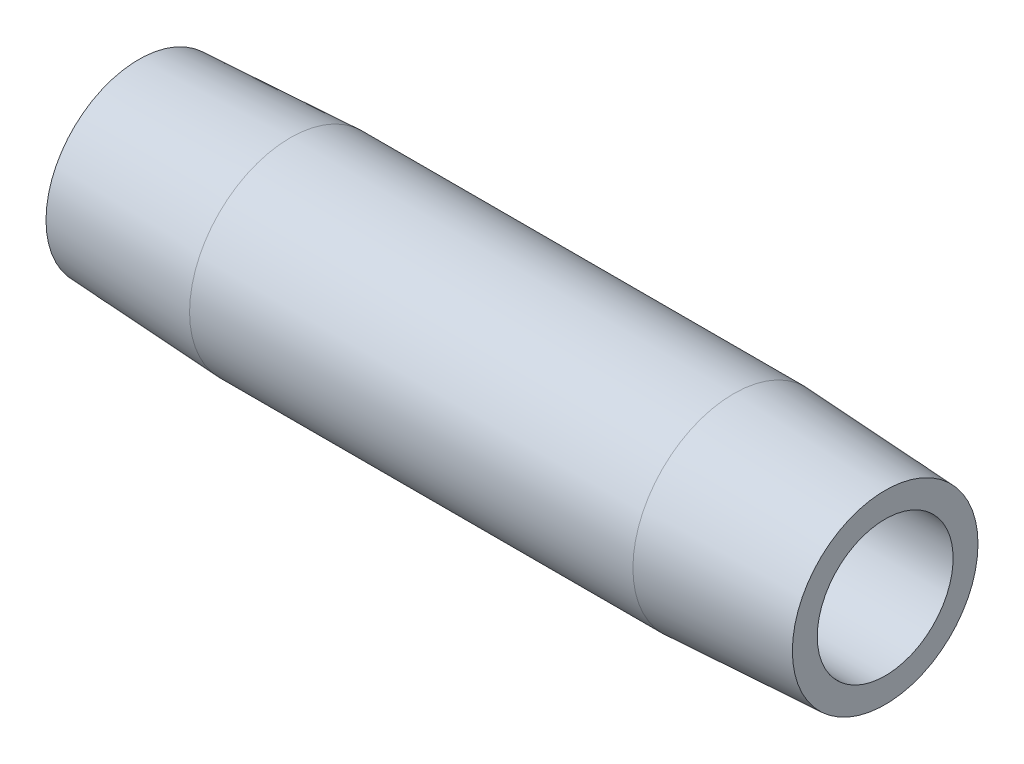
from build123d import *


with BuildPart() as part:
    # Sketch1 → Revolve1 (revolve)
    with BuildSketch(Plane(origin=(0, 0, 0), x_dir=(1, 0, 0), z_dir=(0, 1, 0)), mode=Mode.PRIVATE) as revolve1_sk:
        Polygon((50.8, 4.622776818), (0, 4.622776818), (0, 6.317526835), (10.3124, 6.857976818), (40.4876, 6.857976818), (50.8, 6.317526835), align=None)
    revolve(revolve1_sk.sketch.rotate(Axis((-6.375994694, 0, 0), (1, 0, 0)), 180), axis=Axis((-6.375994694, 0, 0), (1, 0, 0)))


solid = part.part
